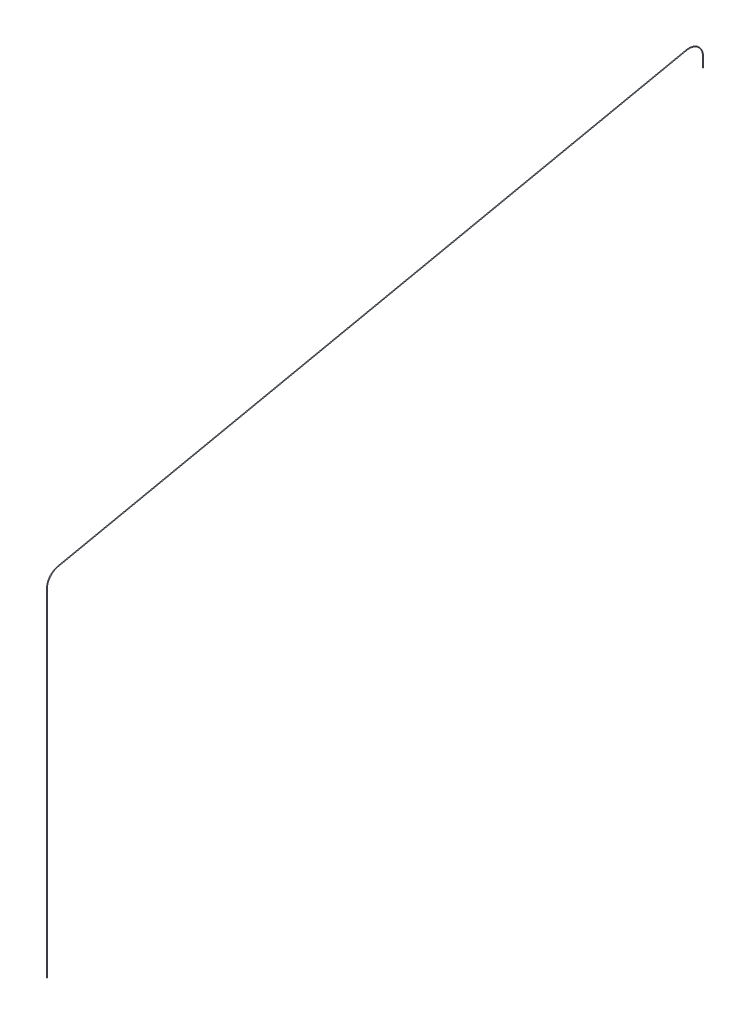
ISO-10303-21;
HEADER;
FILE_DESCRIPTION(('STEP AP214'),'2;1');
FILE_NAME('part.step','',(''),(''),'','','');
FILE_SCHEMA(('AUTOMOTIVE_DESIGN { 1 0 10303 214 1 1 1 1 }'));
ENDSEC;
DATA;
#1=APPLICATION_CONTEXT('core data for automotive mechanical design processes');
#2=APPLICATION_PROTOCOL_DEFINITION('international standard','automotive_design',2000,#1);
#3=PRODUCT_CONTEXT('',#1,'mechanical');
#4=PRODUCT('Part','Part','',(#3));
#5=PRODUCT_RELATED_PRODUCT_CATEGORY('part','',(#4));
#6=PRODUCT_DEFINITION_FORMATION('','',#4);
#7=PRODUCT_DEFINITION_CONTEXT('part definition',#1,'design');
#8=PRODUCT_DEFINITION('design','',#6,#7);
#9=PRODUCT_DEFINITION_SHAPE('','',#8);
#10=(LENGTH_UNIT() NAMED_UNIT(*) SI_UNIT(.MILLI.,.METRE.));
#11=(NAMED_UNIT(*) PLANE_ANGLE_UNIT() SI_UNIT($,.RADIAN.));
#12=(NAMED_UNIT(*) SI_UNIT($,.STERADIAN.) SOLID_ANGLE_UNIT());
#13=UNCERTAINTY_MEASURE_WITH_UNIT(LENGTH_MEASURE(1.E-05),#10,'distance_accuracy_value','');
#14=(GEOMETRIC_REPRESENTATION_CONTEXT(3) GLOBAL_UNCERTAINTY_ASSIGNED_CONTEXT((#13)) GLOBAL_UNIT_ASSIGNED_CONTEXT((#10,
#11,#12)) REPRESENTATION_CONTEXT('',''));
#15=CARTESIAN_POINT('',(0.,0.,0.));
#16=DIRECTION('',(0.,0.,1.));
#17=DIRECTION('',(1.,0.,0.));
#18=AXIS2_PLACEMENT_3D('',#15,#16,#17);
#19=CARTESIAN_POINT('',(0.,3939.1,-19047.2));
#20=DIRECTION('',(0.,-1.,0.));
#21=DIRECTION('',(0.,0.,-1.));
#22=AXIS2_PLACEMENT_3D('',#19,#20,#21);
#23=CYLINDRICAL_SURFACE('',#22,9.50000000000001);
#24=CARTESIAN_POINT('',(0.,3939.1,-19047.2));
#25=DIRECTION('',(0.,-1.,0.));
#26=DIRECTION('',(0.,0.,-1.));
#27=AXIS2_PLACEMENT_3D('',#24,#25,#26);
#28=CIRCLE('',#27,9.50000000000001);
#29=CARTESIAN_POINT('',(0.,3939.1,-19056.7));
#30=VERTEX_POINT('',#29);
#31=EDGE_CURVE('E37',#30,#30,#28,.T.);
#32=ORIENTED_EDGE('',*,*,#31,.T.);
#33=EDGE_LOOP('',(#32));
#34=FACE_BOUND('',#33,.T.);
#35=CARTESIAN_POINT('',(0.,3645.12152295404,-19047.2));
#36=DIRECTION('',(0.,-1.,0.));
#37=DIRECTION('',(0.,0.,-1.));
#38=AXIS2_PLACEMENT_3D('',#35,#36,#37);
#39=CIRCLE('',#38,9.50000000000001);
#40=CARTESIAN_POINT('',(0.,3645.12152295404,-19056.7));
#41=VERTEX_POINT('',#40);
#42=EDGE_CURVE('E10',#41,#41,#39,.T.);
#43=ORIENTED_EDGE('',*,*,#42,.F.);
#44=EDGE_LOOP('',(#43));
#45=FACE_BOUND('',#44,.T.);
#46=ADVANCED_FACE('F31',(#34,#45),#23,.T.);
#47=CARTESIAN_POINT('',(0.,3939.1,-18632.2));
#48=DIRECTION('',(-1.,0.,0.));
#49=DIRECTION('',(0.,0.,1.));
#50=AXIS2_PLACEMENT_3D('',#47,#48,#49);
#51=TOROIDAL_SURFACE('',#50,415.000000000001,9.50000000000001);
#52=CARTESIAN_POINT('',(0.,4345.13079909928,-18546.386305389));
#53=DIRECTION('',(0.,0.206779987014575,-0.978387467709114));
#54=DIRECTION('',(0.,0.978387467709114,0.206779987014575));
#55=AXIS2_PLACEMENT_3D('',#52,#53,#54);
#56=CIRCLE('',#55,9.50000000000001);
#57=CARTESIAN_POINT('',(0.,4354.42548004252,-18544.4218955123));
#58=VERTEX_POINT('',#57);
#59=EDGE_CURVE('E41',#58,#58,#56,.T.);
#60=CARTESIAN_POINT('',(0.,3939.1,-18632.2));
#61=DIRECTION('',(-1.,0.,0.));
#62=DIRECTION('',(0.,0.,1.));
#63=AXIS2_PLACEMENT_3D('',#60,#61,#62);
#64=CIRCLE('',#63,424.500000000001);
#65=EDGE_CURVE('',#58,#30,#64,.T.);
#66=ORIENTED_EDGE('',*,*,#59,.T.);
#67=ORIENTED_EDGE('',*,*,#31,.F.);
#68=ORIENTED_EDGE('',*,*,#65,.T.);
#69=ORIENTED_EDGE('',*,*,#65,.F.);
#70=EDGE_LOOP('',(#66,#68,#67,#69));
#71=FACE_BOUND('',#70,.T.);
#72=ADVANCED_FACE('F75',(#71),#51,.T.);
#73=CARTESIAN_POINT('',(0.,407.204864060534,86.0618305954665));
#74=DIRECTION('',(0.,0.206779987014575,-0.978387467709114));
#75=DIRECTION('',(0.,0.978387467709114,0.206779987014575));
#76=AXIS2_PLACEMENT_3D('',#73,#74,#75);
#77=CYLINDRICAL_SURFACE('',#76,9.50000000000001);
#78=CARTESIAN_POINT('',(0.,407.204864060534,86.0618305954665));
#79=DIRECTION('',(0.,0.206779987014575,-0.978387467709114));
#80=DIRECTION('',(0.,0.978387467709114,0.206779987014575));
#81=AXIS2_PLACEMENT_3D('',#78,#79,#80);
#82=CIRCLE('',#81,9.50000000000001);
#83=CARTESIAN_POINT('',(0.,416.499545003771,88.0262404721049));
#84=VERTEX_POINT('',#83);
#85=EDGE_CURVE('E45',#84,#84,#82,.T.);
#86=ORIENTED_EDGE('',*,*,#85,.T.);
#87=EDGE_LOOP('',(#86));
#88=FACE_BOUND('',#87,.T.);
#89=ORIENTED_EDGE('',*,*,#59,.F.);
#90=EDGE_LOOP('',(#89));
#91=FACE_BOUND('',#90,.T.);
#92=ADVANCED_FACE('F79',(#88,#91),#77,.T.);
#93=CARTESIAN_POINT('',(0.,0.,0.));
#94=DIRECTION('',(-1.,0.,0.));
#95=DIRECTION('',(0.,0.,1.));
#96=AXIS2_PLACEMENT_3D('',#93,#94,#95);
#97=TOROIDAL_SURFACE('',#96,416.200000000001,9.50000000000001);
#98=CARTESIAN_POINT('',(0.,0.,416.200000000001));
#99=DIRECTION('',(0.,1.,0.));
#100=DIRECTION('',(0.,0.,1.));
#101=AXIS2_PLACEMENT_3D('',#98,#99,#100);
#102=CIRCLE('',#101,9.50000000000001);
#103=CARTESIAN_POINT('',(0.,0.,425.700000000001));
#104=VERTEX_POINT('',#103);
#105=EDGE_CURVE('E50',#104,#104,#102,.T.);
#106=CARTESIAN_POINT('',(0.,0.,0.));
#107=DIRECTION('',(-1.,0.,0.));
#108=DIRECTION('',(0.,0.,1.));
#109=AXIS2_PLACEMENT_3D('',#106,#107,#108);
#110=CIRCLE('',#109,425.700000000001);
#111=EDGE_CURVE('',#104,#84,#110,.T.);
#112=ORIENTED_EDGE('',*,*,#105,.T.);
#113=ORIENTED_EDGE('',*,*,#85,.F.);
#114=ORIENTED_EDGE('',*,*,#111,.T.);
#115=ORIENTED_EDGE('',*,*,#111,.F.);
#116=EDGE_LOOP('',(#112,#114,#113,#115));
#117=FACE_BOUND('',#116,.T.);
#118=ADVANCED_FACE('F57',(#117),#97,.T.);
#119=CARTESIAN_POINT('',(0.,0.,416.200000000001));
#120=DIRECTION('',(0.,-1.,0.));
#121=DIRECTION('',(0.,0.,-1.));
#122=AXIS2_PLACEMENT_3D('',#119,#120,#121);
#123=CYLINDRICAL_SURFACE('',#122,9.50000000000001);
#124=ORIENTED_EDGE('',*,*,#105,.F.);
#125=EDGE_LOOP('',(#124));
#126=FACE_BOUND('',#125,.T.);
#127=CARTESIAN_POINT('',(0.,-10000.,416.2));
#128=DIRECTION('',(0.,1.,0.));
#129=DIRECTION('',(0.,0.,1.));
#130=AXIS2_PLACEMENT_3D('',#127,#128,#129);
#131=CIRCLE('',#130,9.50000000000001);
#132=CARTESIAN_POINT('',(0.,-10000.,425.7));
#133=VERTEX_POINT('',#132);
#134=EDGE_CURVE('E51',#133,#133,#131,.T.);
#135=ORIENTED_EDGE('',*,*,#134,.T.);
#136=EDGE_LOOP('',(#135));
#137=FACE_BOUND('',#136,.T.);
#138=ADVANCED_FACE('F60',(#126,#137),#123,.T.);
#139=CARTESIAN_POINT('',(0.,3645.12152295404,-19047.2));
#140=DIRECTION('',(0.,-1.,0.));
#141=DIRECTION('',(0.,0.,-1.));
#142=AXIS2_PLACEMENT_3D('',#139,#140,#141);
#143=PLANE('',#142);
#144=ORIENTED_EDGE('',*,*,#42,.T.);
#145=EDGE_LOOP('',(#144));
#146=FACE_BOUND('',#145,.T.);
#147=ADVANCED_FACE('F63',(#146),#143,.T.);
#148=CARTESIAN_POINT('',(0.,-10000.,416.2));
#149=DIRECTION('',(0.,1.,0.));
#150=DIRECTION('',(0.,0.,1.));
#151=AXIS2_PLACEMENT_3D('',#148,#149,#150);
#152=PLANE('',#151);
#153=ORIENTED_EDGE('',*,*,#134,.F.);
#154=EDGE_LOOP('',(#153));
#155=FACE_BOUND('',#154,.T.);
#156=ADVANCED_FACE('F67',(#155),#152,.F.);
#157=CLOSED_SHELL('',(#46,#72,#92,#118,#138,#147,#156));
#158=MANIFOLD_SOLID_BREP('B2',#157);
#159=ADVANCED_BREP_SHAPE_REPRESENTATION('',(#18,#158),#14);
#160=SHAPE_DEFINITION_REPRESENTATION(#9,#159);
ENDSEC;
END-ISO-10303-21;
